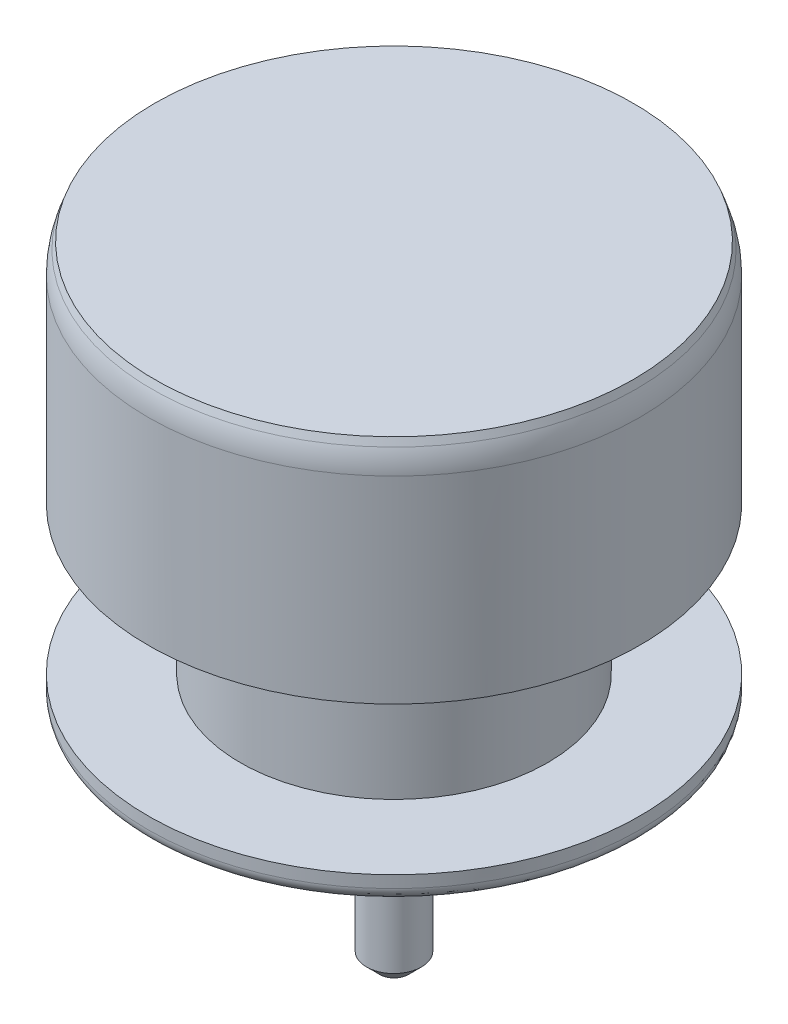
from build123d import *

# Parameters (mm, degrees)
FILLET1_R     = 0.2
FILLET2_R     = 1
CHAMFER1_SIZE = 0.2


with BuildPart() as part:
    # Sketch1 → Revolve1 (revolve)
    with BuildSketch(Plane.XY, mode=Mode.PRIVATE) as revolve1_sk:
        Polygon((0, 0), (0, -9.6), (0.42, -9.6), (0.42, -7.957512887), (3.76, -6.029162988), (3.76, -5.73), (2.35, -5.73), (2.35, -3.47), (3.76, -3.47), (3.76, -0.274747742), (3.66, 0), align=None)
    revolve(revolve1_sk.sketch.rotate(Axis((0, 0, 0), (0, -1, 0)), 180), axis=Axis((0, 0, 0), (0, -1, 0)))

    # Fillet1
    fillet1_edges = [part.edges().sort_by_distance(p)[0] for p in [
        (3.76, -6.029162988, 0),
    ]]
    fillet(fillet1_edges, radius=FILLET1_R)

    # Fillet2
    fillet2_edges = [part.edges().sort_by_distance(p)[0] for p in [
        (3.76, -0.274747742, 0),
    ]]
    fillet(fillet2_edges, radius=FILLET2_R)

    # Chamfer1
    chamfer1_edges = [part.edges().sort_by_distance(p)[0] for p in [
        (0.42, -9.6, 0),
    ]]
    chamfer(chamfer1_edges, length=CHAMFER1_SIZE)


solid = part.part
